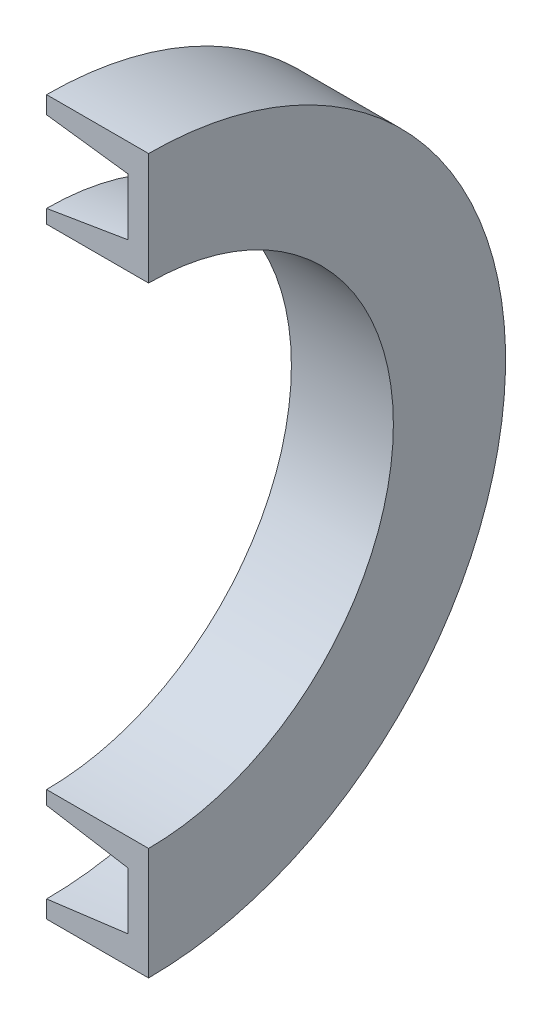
ISO-10303-21;
HEADER;
FILE_DESCRIPTION(('STEP AP214'),'2;1');
FILE_NAME('part.step','',(''),(''),'','','');
FILE_SCHEMA(('AUTOMOTIVE_DESIGN { 1 0 10303 214 1 1 1 1 }'));
ENDSEC;
DATA;
#1=APPLICATION_CONTEXT('core data for automotive mechanical design processes');
#2=APPLICATION_PROTOCOL_DEFINITION('international standard','automotive_design',2000,#1);
#3=PRODUCT_CONTEXT('',#1,'mechanical');
#4=PRODUCT('Part','Part','',(#3));
#5=PRODUCT_RELATED_PRODUCT_CATEGORY('part','',(#4));
#6=PRODUCT_DEFINITION_FORMATION('','',#4);
#7=PRODUCT_DEFINITION_CONTEXT('part definition',#1,'design');
#8=PRODUCT_DEFINITION('design','',#6,#7);
#9=PRODUCT_DEFINITION_SHAPE('','',#8);
#10=(LENGTH_UNIT() NAMED_UNIT(*) SI_UNIT(.MILLI.,.METRE.));
#11=(NAMED_UNIT(*) PLANE_ANGLE_UNIT() SI_UNIT($,.RADIAN.));
#12=(NAMED_UNIT(*) SI_UNIT($,.STERADIAN.) SOLID_ANGLE_UNIT());
#13=UNCERTAINTY_MEASURE_WITH_UNIT(LENGTH_MEASURE(1.E-05),#10,'distance_accuracy_value','');
#14=(GEOMETRIC_REPRESENTATION_CONTEXT(3) GLOBAL_UNCERTAINTY_ASSIGNED_CONTEXT((#13)) GLOBAL_UNIT_ASSIGNED_CONTEXT((#10,
#11,#12)) REPRESENTATION_CONTEXT('',''));
#15=CARTESIAN_POINT('',(0.,0.,0.));
#16=DIRECTION('',(0.,0.,1.));
#17=DIRECTION('',(1.,0.,0.));
#18=AXIS2_PLACEMENT_3D('',#15,#16,#17);
#19=CARTESIAN_POINT('',(-15.,17.5,0.));
#20=DIRECTION('',(1.,0.,0.));
#21=DIRECTION('',(0.,0.,-1.));
#22=AXIS2_PLACEMENT_3D('',#19,#20,#21);
#23=PLANE('',#22);
#24=DIRECTION('',(0.,1.,0.));
#25=VECTOR('',#24,1.);
#26=CARTESIAN_POINT('',(-15.,20.,0.));
#27=LINE('',#26,#25);
#28=CARTESIAN_POINT('',(-15.,-17.5,0.));
#29=VERTEX_POINT('',#28);
#30=CARTESIAN_POINT('',(-15.,-12.,0.));
#31=VERTEX_POINT('',#30);
#32=EDGE_CURVE('E86',#29,#31,#27,.T.);
#33=ORIENTED_EDGE('',*,*,#32,.F.);
#34=CARTESIAN_POINT('',(-15.,0.,0.));
#35=DIRECTION('',(1.,0.,0.));
#36=DIRECTION('',(0.,0.,-1.));
#37=AXIS2_PLACEMENT_3D('',#34,#35,#36);
#38=CIRCLE('',#37,17.5);
#39=CARTESIAN_POINT('',(-15.,17.5,0.));
#40=VERTEX_POINT('',#39);
#41=EDGE_CURVE('E96',#29,#40,#38,.T.);
#42=ORIENTED_EDGE('',*,*,#41,.T.);
#43=CARTESIAN_POINT('',(-15.,12.,0.));
#44=VERTEX_POINT('',#43);
#45=EDGE_CURVE('E37',#44,#40,#27,.T.);
#46=ORIENTED_EDGE('',*,*,#45,.F.);
#47=CARTESIAN_POINT('',(-15.,0.,0.));
#48=DIRECTION('',(1.,0.,0.));
#49=DIRECTION('',(0.,0.,-1.));
#50=AXIS2_PLACEMENT_3D('',#47,#48,#49);
#51=CIRCLE('',#50,12.);
#52=EDGE_CURVE('E92',#31,#44,#51,.T.);
#53=ORIENTED_EDGE('',*,*,#52,.F.);
#54=EDGE_LOOP('',(#33,#42,#46,#53));
#55=FACE_BOUND('',#54,.T.);
#56=ADVANCED_FACE('F24',(#55),#23,.T.);
#57=CARTESIAN_POINT('',(0.,0.,0.));
#58=DIRECTION('',(1.,0.,0.));
#59=DIRECTION('',(0.,0.,-1.));
#60=AXIS2_PLACEMENT_3D('',#57,#58,#59);
#61=CYLINDRICAL_SURFACE('',#60,12.);
#62=DIRECTION('',(1.,0.,0.));
#63=VECTOR('',#62,1.);
#64=CARTESIAN_POINT('',(0.,12.,0.));
#65=LINE('',#64,#63);
#66=CARTESIAN_POINT('',(-20.,12.,0.));
#67=VERTEX_POINT('',#66);
#68=EDGE_CURVE('E102',#67,#44,#65,.T.);
#69=ORIENTED_EDGE('',*,*,#68,.F.);
#70=CARTESIAN_POINT('',(-20.,0.,0.));
#71=DIRECTION('',(1.,0.,0.));
#72=DIRECTION('',(0.,0.,-1.));
#73=AXIS2_PLACEMENT_3D('',#70,#71,#72);
#74=CIRCLE('',#73,12.);
#75=CARTESIAN_POINT('',(-20.,-12.,0.));
#76=VERTEX_POINT('',#75);
#77=EDGE_CURVE('E121',#76,#67,#74,.T.);
#78=ORIENTED_EDGE('',*,*,#77,.F.);
#79=DIRECTION('',(1.,0.,0.));
#80=VECTOR('',#79,1.);
#81=CARTESIAN_POINT('',(0.,-12.,0.));
#82=LINE('',#81,#80);
#83=EDGE_CURVE('E106',#31,#76,#82,.F.);
#84=ORIENTED_EDGE('',*,*,#83,.F.);
#85=ORIENTED_EDGE('',*,*,#52,.T.);
#86=EDGE_LOOP('',(#69,#78,#84,#85));
#87=FACE_BOUND('',#86,.T.);
#88=ADVANCED_FACE('F126',(#87),#61,.F.);
#89=CARTESIAN_POINT('',(-20.,12.6717692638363,0.));
#90=DIRECTION('',(-1.,0.,0.));
#91=DIRECTION('',(0.,0.,1.));
#92=AXIS2_PLACEMENT_3D('',#89,#90,#91);
#93=PLANE('',#92);
#94=DIRECTION('',(0.,1.,0.));
#95=VECTOR('',#94,1.);
#96=CARTESIAN_POINT('',(-20.,20.,0.));
#97=LINE('',#96,#95);
#98=CARTESIAN_POINT('',(-20.,12.6717692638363,0.));
#99=VERTEX_POINT('',#98);
#100=EDGE_CURVE('E142',#67,#99,#97,.T.);
#101=ORIENTED_EDGE('',*,*,#100,.T.);
#102=CARTESIAN_POINT('',(-20.,0.,0.));
#103=DIRECTION('',(1.,0.,0.));
#104=DIRECTION('',(0.,0.,-1.));
#105=AXIS2_PLACEMENT_3D('',#102,#103,#104);
#106=CIRCLE('',#105,12.6717692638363);
#107=CARTESIAN_POINT('',(-20.,-12.6717692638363,0.));
#108=VERTEX_POINT('',#107);
#109=EDGE_CURVE('E118',#108,#99,#106,.T.);
#110=ORIENTED_EDGE('',*,*,#109,.F.);
#111=EDGE_CURVE('E145',#108,#76,#97,.T.);
#112=ORIENTED_EDGE('',*,*,#111,.T.);
#113=ORIENTED_EDGE('',*,*,#77,.T.);
#114=EDGE_LOOP('',(#101,#110,#112,#113));
#115=FACE_BOUND('',#114,.T.);
#116=ADVANCED_FACE('F149',(#115),#93,.T.);
#117=CARTESIAN_POINT('',(-16.,0.,0.));
#118=DIRECTION('',(1.,0.,0.));
#119=DIRECTION('',(0.,0.,-1.));
#120=AXIS2_PLACEMENT_3D('',#117,#118,#119);
#121=CONICAL_SURFACE('',#120,13.3343538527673,0.164155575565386);
#122=DIRECTION('',(0.986556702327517,0.16341931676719,0.));
#123=VECTOR('',#122,1.);
#124=CARTESIAN_POINT('',(-96.4990280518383,0.,0.));
#125=LINE('',#124,#123);
#126=CARTESIAN_POINT('',(-16.,13.3343538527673,0.));
#127=VERTEX_POINT('',#126);
#128=EDGE_CURVE('E135',#127,#99,#125,.F.);
#129=ORIENTED_EDGE('',*,*,#128,.F.);
#130=CARTESIAN_POINT('',(-16.,0.,0.));
#131=DIRECTION('',(1.,0.,0.));
#132=DIRECTION('',(0.,0.,-1.));
#133=AXIS2_PLACEMENT_3D('',#130,#131,#132);
#134=CIRCLE('',#133,13.3343538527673);
#135=CARTESIAN_POINT('',(-16.,-13.3343538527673,0.));
#136=VERTEX_POINT('',#135);
#137=EDGE_CURVE('E115',#136,#127,#134,.T.);
#138=ORIENTED_EDGE('',*,*,#137,.F.);
#139=DIRECTION('',(-0.986556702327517,0.16341931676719,0.));
#140=VECTOR('',#139,1.);
#141=CARTESIAN_POINT('',(-96.4990280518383,0.,0.));
#142=LINE('',#141,#140);
#143=EDGE_CURVE('E129',#108,#136,#142,.F.);
#144=ORIENTED_EDGE('',*,*,#143,.F.);
#145=ORIENTED_EDGE('',*,*,#109,.T.);
#146=EDGE_LOOP('',(#129,#138,#144,#145));
#147=FACE_BOUND('',#146,.T.);
#148=ADVANCED_FACE('F155',(#147),#121,.T.);
#149=CARTESIAN_POINT('',(-16.,16.1288337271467,0.));
#150=DIRECTION('',(-1.,0.,0.));
#151=DIRECTION('',(0.,0.,1.));
#152=AXIS2_PLACEMENT_3D('',#149,#150,#151);
#153=PLANE('',#152);
#154=DIRECTION('',(0.,-1.,0.));
#155=VECTOR('',#154,1.);
#156=CARTESIAN_POINT('',(-16.,16.1288337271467,0.));
#157=LINE('',#156,#155);
#158=CARTESIAN_POINT('',(-16.,16.1288337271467,0.));
#159=VERTEX_POINT('',#158);
#160=EDGE_CURVE('E137',#159,#127,#157,.T.);
#161=ORIENTED_EDGE('',*,*,#160,.F.);
#162=CARTESIAN_POINT('',(-16.,0.,0.));
#163=DIRECTION('',(1.,0.,0.));
#164=DIRECTION('',(0.,0.,-1.));
#165=AXIS2_PLACEMENT_3D('',#162,#163,#164);
#166=CIRCLE('',#165,16.1288337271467);
#167=CARTESIAN_POINT('',(-16.,-16.1288337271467,0.));
#168=VERTEX_POINT('',#167);
#169=EDGE_CURVE('E112',#168,#159,#166,.T.);
#170=ORIENTED_EDGE('',*,*,#169,.F.);
#171=EDGE_CURVE('E130',#136,#168,#157,.T.);
#172=ORIENTED_EDGE('',*,*,#171,.F.);
#173=ORIENTED_EDGE('',*,*,#137,.T.);
#174=EDGE_LOOP('',(#161,#170,#172,#173));
#175=FACE_BOUND('',#174,.T.);
#176=ADVANCED_FACE('F158',(#175),#153,.T.);
#177=CARTESIAN_POINT('',(-20.,0.,0.));
#178=DIRECTION('',(-1.,0.,0.));
#179=DIRECTION('',(0.,0.,1.));
#180=AXIS2_PLACEMENT_3D('',#177,#178,#179);
#181=CONICAL_SURFACE('',#180,16.6441686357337,0.128127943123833);
#182=DIRECTION('',(-0.991802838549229,-0.127777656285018,0.));
#183=VECTOR('',#182,1.);
#184=CARTESIAN_POINT('',(109.191082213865,0.,0.));
#185=LINE('',#184,#183);
#186=CARTESIAN_POINT('',(-20.,-16.6441686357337,0.));
#187=VERTEX_POINT('',#186);
#188=EDGE_CURVE('E133',#168,#187,#185,.T.);
#189=ORIENTED_EDGE('',*,*,#188,.F.);
#190=ORIENTED_EDGE('',*,*,#169,.T.);
#191=DIRECTION('',(0.991802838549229,-0.127777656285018,0.));
#192=VECTOR('',#191,1.);
#193=CARTESIAN_POINT('',(109.191082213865,0.,0.));
#194=LINE('',#193,#192);
#195=CARTESIAN_POINT('',(-20.,16.6441686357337,0.));
#196=VERTEX_POINT('',#195);
#197=EDGE_CURVE('E139',#196,#159,#194,.T.);
#198=ORIENTED_EDGE('',*,*,#197,.F.);
#199=CARTESIAN_POINT('',(-20.,0.,0.));
#200=DIRECTION('',(1.,0.,0.));
#201=DIRECTION('',(0.,0.,-1.));
#202=AXIS2_PLACEMENT_3D('',#199,#200,#201);
#203=CIRCLE('',#202,16.6441686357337);
#204=EDGE_CURVE('E104',#187,#196,#203,.T.);
#205=ORIENTED_EDGE('',*,*,#204,.F.);
#206=EDGE_LOOP('',(#189,#190,#198,#205));
#207=FACE_BOUND('',#206,.T.);
#208=ADVANCED_FACE('F162',(#207),#181,.F.);
#209=CARTESIAN_POINT('',(-20.,17.5,0.));
#210=DIRECTION('',(-1.,0.,0.));
#211=DIRECTION('',(0.,0.,1.));
#212=AXIS2_PLACEMENT_3D('',#209,#210,#211);
#213=PLANE('',#212);
#214=CARTESIAN_POINT('',(-20.,17.5,0.));
#215=VERTEX_POINT('',#214);
#216=EDGE_CURVE('E98',#196,#215,#97,.T.);
#217=ORIENTED_EDGE('',*,*,#216,.T.);
#218=CARTESIAN_POINT('',(-20.,0.,0.));
#219=DIRECTION('',(1.,0.,0.));
#220=DIRECTION('',(0.,0.,-1.));
#221=AXIS2_PLACEMENT_3D('',#218,#219,#220);
#222=CIRCLE('',#221,17.5);
#223=CARTESIAN_POINT('',(-20.,-17.5,0.));
#224=VERTEX_POINT('',#223);
#225=EDGE_CURVE('E101',#224,#215,#222,.T.);
#226=ORIENTED_EDGE('',*,*,#225,.F.);
#227=EDGE_CURVE('E45',#224,#187,#97,.T.);
#228=ORIENTED_EDGE('',*,*,#227,.T.);
#229=ORIENTED_EDGE('',*,*,#204,.T.);
#230=EDGE_LOOP('',(#217,#226,#228,#229));
#231=FACE_BOUND('',#230,.T.);
#232=ADVANCED_FACE('F164',(#231),#213,.T.);
#233=CARTESIAN_POINT('',(0.,0.,0.));
#234=DIRECTION('',(1.,0.,0.));
#235=DIRECTION('',(0.,0.,-1.));
#236=AXIS2_PLACEMENT_3D('',#233,#234,#235);
#237=CYLINDRICAL_SURFACE('',#236,17.5);
#238=DIRECTION('',(1.,0.,0.));
#239=VECTOR('',#238,1.);
#240=CARTESIAN_POINT('',(0.,17.5,0.));
#241=LINE('',#240,#239);
#242=EDGE_CURVE('E11',#40,#215,#241,.F.);
#243=ORIENTED_EDGE('',*,*,#242,.F.);
#244=ORIENTED_EDGE('',*,*,#41,.F.);
#245=DIRECTION('',(1.,0.,0.));
#246=VECTOR('',#245,1.);
#247=CARTESIAN_POINT('',(0.,-17.5,0.));
#248=LINE('',#247,#246);
#249=EDGE_CURVE('E31',#224,#29,#248,.T.);
#250=ORIENTED_EDGE('',*,*,#249,.F.);
#251=ORIENTED_EDGE('',*,*,#225,.T.);
#252=EDGE_LOOP('',(#243,#244,#250,#251));
#253=FACE_BOUND('',#252,.T.);
#254=ADVANCED_FACE('F100',(#253),#237,.T.);
#255=CARTESIAN_POINT('',(-20.,20.,0.));
#256=DIRECTION('',(0.,0.,-1.));
#257=DIRECTION('',(-1.,0.,0.));
#258=AXIS2_PLACEMENT_3D('',#255,#256,#257);
#259=PLANE('',#258);
#260=ORIENTED_EDGE('',*,*,#83,.T.);
#261=ORIENTED_EDGE('',*,*,#111,.F.);
#262=ORIENTED_EDGE('',*,*,#143,.T.);
#263=ORIENTED_EDGE('',*,*,#171,.T.);
#264=ORIENTED_EDGE('',*,*,#188,.T.);
#265=ORIENTED_EDGE('',*,*,#227,.F.);
#266=ORIENTED_EDGE('',*,*,#249,.T.);
#267=ORIENTED_EDGE('',*,*,#32,.T.);
#268=EDGE_LOOP('',(#260,#261,#262,#263,#264,#265,#266,#267));
#269=FACE_BOUND('',#268,.T.);
#270=ADVANCED_FACE('F85',(#269),#259,.F.);
#271=ORIENTED_EDGE('',*,*,#68,.T.);
#272=ORIENTED_EDGE('',*,*,#45,.T.);
#273=ORIENTED_EDGE('',*,*,#242,.T.);
#274=ORIENTED_EDGE('',*,*,#216,.F.);
#275=ORIENTED_EDGE('',*,*,#197,.T.);
#276=ORIENTED_EDGE('',*,*,#160,.T.);
#277=ORIENTED_EDGE('',*,*,#128,.T.);
#278=ORIENTED_EDGE('',*,*,#100,.F.);
#279=EDGE_LOOP('',(#271,#272,#273,#274,#275,#276,#277,#278));
#280=FACE_BOUND('',#279,.T.);
#281=ADVANCED_FACE('F206',(#280),#259,.F.);
#282=CLOSED_SHELL('',(#56,#88,#116,#148,#176,#208,#232,#254,#270,#281));
#283=MANIFOLD_SOLID_BREP('B2',#282);
#284=ADVANCED_BREP_SHAPE_REPRESENTATION('',(#18,#283),#14);
#285=SHAPE_DEFINITION_REPRESENTATION(#9,#284);
ENDSEC;
END-ISO-10303-21;
